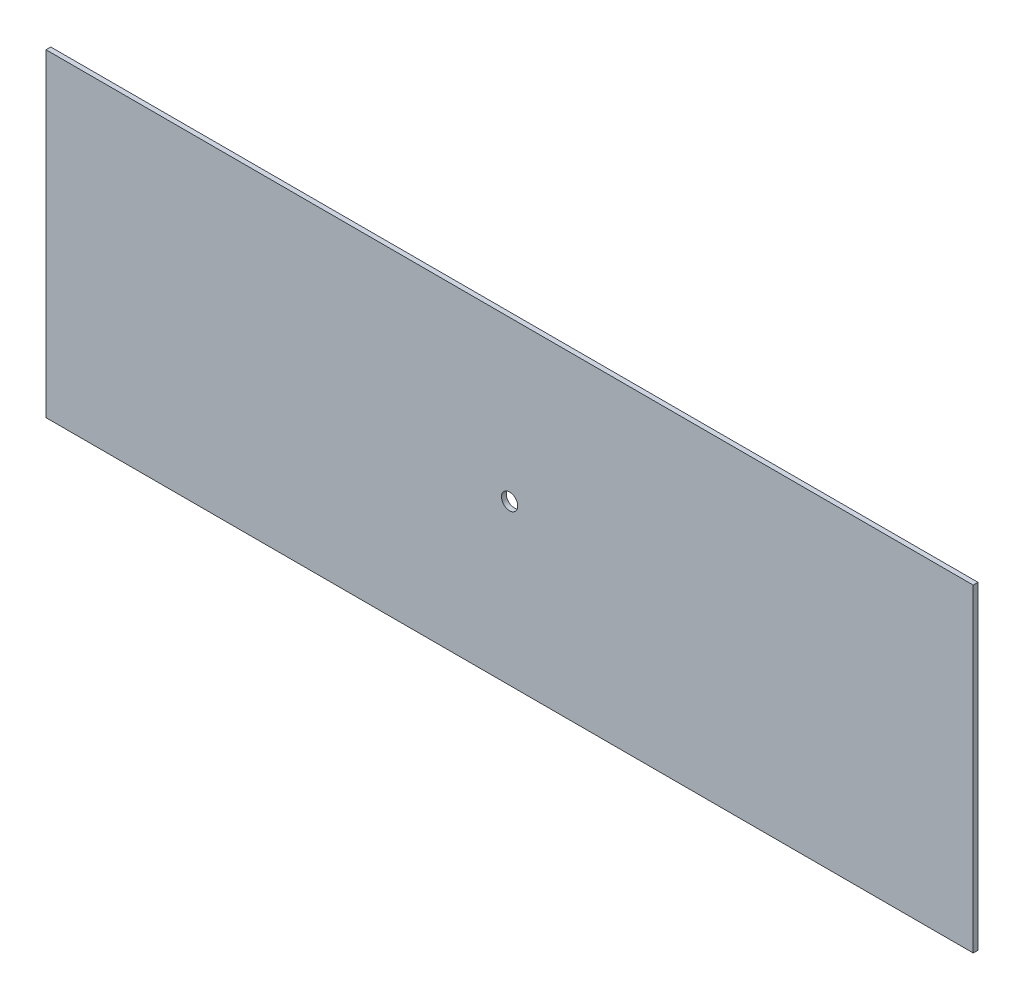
from build123d import *

# Parameters (mm, degrees)
SKETCH1_W                    = 157.1244
SKETCH1_H                    = 2.3622
PANEL_OR_BLOCK_DEPTH         = 457.2
ROD_CLEARANCE_8MM_DEPTH      = 471.505981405
ROD_CLEARANCE_8MM_DEPTH_BACK = 471.505981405
SKETCH4_R                    = 4


with BuildPart() as part:
    # Sketch1 → Panel_or_block (new body)
    with BuildSketch(Plane.YZ):
        with Locations((0, -77.3811)):
            Rectangle(SKETCH1_W, SKETCH1_H)
    extrude(amount=PANEL_OR_BLOCK_DEPTH)

    # Sketch4 → Rod_clearance_8mm (cut, two sides: drawn at the far end of the back side and taken through both)
    with BuildSketch(Plane(origin=(0, 0, 0), x_dir=(0, 1, 0), z_dir=(0, 0, 1)).offset(-ROD_CLEARANCE_8MM_DEPTH_BACK)):
        with Locations(Location((0, -228.6, 0), (0, 0, 270))):
            Circle(SKETCH4_R)
    extrude(amount=ROD_CLEARANCE_8MM_DEPTH + ROD_CLEARANCE_8MM_DEPTH_BACK, mode=Mode.SUBTRACT)


solid = part.part
